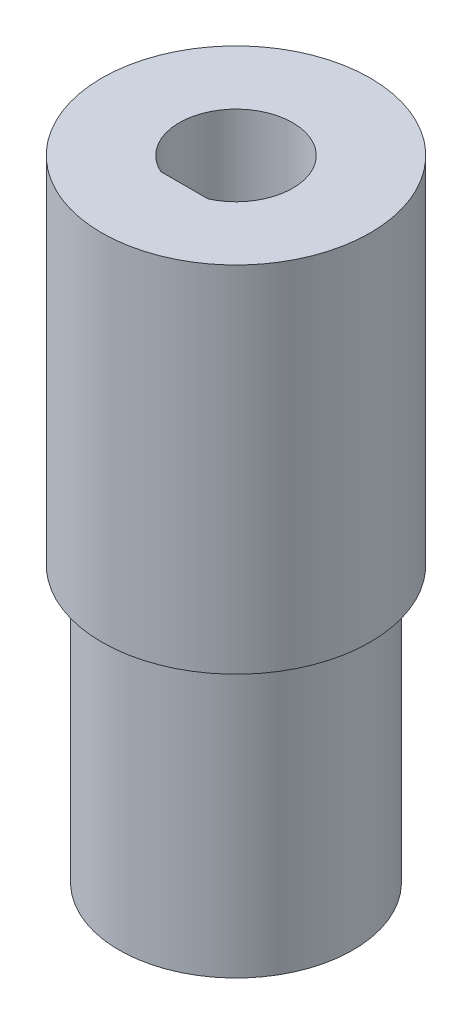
from build123d import *

# Parameters (mm, degrees)
SCHNITT_LINEAR_AUSTRAGEN1_DEPTH = 8
SCHNITT_LINEAR_AUSTRAGEN2_DEPTH = 10


with BuildPart() as part:
    # Skizze1 → Rotation1 (revolve)
    with BuildSketch(Plane.XY, mode=Mode.PRIVATE) as rotation1_sk:
        Polygon((0, 0), (-3.4, 0), (-3.4, 8), (-3.9, 8), (-3.9, 18.3), (0, 18.3), align=None)
    revolve(rotation1_sk.sketch.rotate(Axis((0, 0, 0), (0, 1, 0)), 270), axis=Axis((0, 0, 0), (0, 1, 0)))

    # Skizze3 → Schnitt-Linear austragen1 (cut)
    with BuildSketch(Plane.XZ):
        with BuildLine():
            Line((0.85, 2.297825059), (0.85, 1.25))
            ThreePointArc((0.85, 1.25), (0.967157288, 0.967157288), (1.25, 0.85))
            Line((1.25, 0.85), (2.297825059, 0.85))
            ThreePointArc((2.297825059, 0.85), (2.411656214, 0.431757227), (2.45, 0))
            ThreePointArc((2.45, 0), (2.411656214, -0.431757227), (2.297825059, -0.85))
            Line((2.297825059, -0.85), (1.25, -0.85))
            ThreePointArc((1.25, -0.85), (0.967157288, -0.967157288), (0.85, -1.25))
            Line((0.85, -1.25), (0.85, -2.297825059))
            ThreePointArc((0.85, -2.297825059), (0.431757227, -2.411656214), (0, -2.45))
            ThreePointArc((0, -2.45), (-0.431757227, -2.411656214), (-0.85, -2.297825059))
            Line((-0.85, -2.297825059), (-0.85, -1.25))
            ThreePointArc((-0.85, -1.25), (-0.967157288, -0.967157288), (-1.25, -0.85))
            Line((-1.25, -0.85), (-2.297825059, -0.85))
            ThreePointArc((-2.297825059, -0.85), (-2.411656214, -0.431757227), (-2.45, 0))
            ThreePointArc((-2.45, 0), (-2.411656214, 0.431757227), (-2.297825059, 0.85))
            Line((-2.297825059, 0.85), (-1.25, 0.85))
            ThreePointArc((-1.25, 0.85), (-0.967157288, 0.967157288), (-0.85, 1.25))
            Line((-0.85, 1.25), (-0.85, 2.297825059))
            ThreePointArc((-0.85, 2.297825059), (-0.431757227, 2.411656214), (0, 2.45))
            ThreePointArc((0, 2.45), (0.431757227, 2.411656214), (0.85, 2.297825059))
        make_face()
    extrude(amount=-SCHNITT_LINEAR_AUSTRAGEN1_DEPTH, mode=Mode.SUBTRACT)

    # Skizze4 → Schnitt-Linear austragen2 (cut)
    with BuildSketch(Plane(origin=(0, 18.3, 0), x_dir=(1, 0, 0), z_dir=(0, 1, 0))):
        with BuildLine():
            Line((-0.687386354, -1.5), (0.687386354, -1.5))
            ThreePointArc((0.687386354, -1.5), (0, 1.65), (-0.687386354, -1.5))
        make_face()
    extrude(amount=-SCHNITT_LINEAR_AUSTRAGEN2_DEPTH, mode=Mode.SUBTRACT)


solid = part.part
